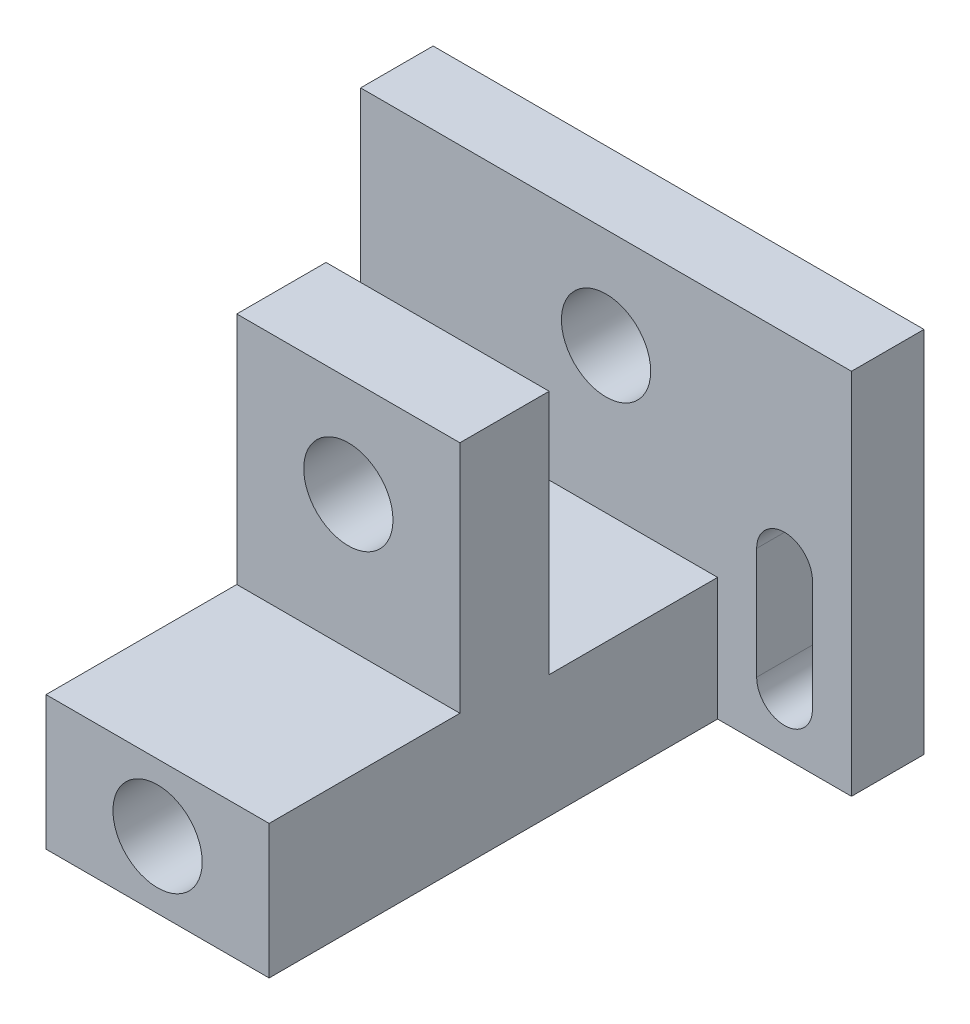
ISO-10303-21;
HEADER;
FILE_DESCRIPTION(('STEP AP214'),'2;1');
FILE_NAME('part.step','',(''),(''),'','','');
FILE_SCHEMA(('AUTOMOTIVE_DESIGN { 1 0 10303 214 1 1 1 1 }'));
ENDSEC;
DATA;
#1=APPLICATION_CONTEXT('core data for automotive mechanical design processes');
#2=APPLICATION_PROTOCOL_DEFINITION('international standard','automotive_design',2000,#1);
#3=PRODUCT_CONTEXT('',#1,'mechanical');
#4=PRODUCT('Part','Part','',(#3));
#5=PRODUCT_RELATED_PRODUCT_CATEGORY('part','',(#4));
#6=PRODUCT_DEFINITION_FORMATION('','',#4);
#7=PRODUCT_DEFINITION_CONTEXT('part definition',#1,'design');
#8=PRODUCT_DEFINITION('design','',#6,#7);
#9=PRODUCT_DEFINITION_SHAPE('','',#8);
#10=(LENGTH_UNIT() NAMED_UNIT(*) SI_UNIT(.MILLI.,.METRE.));
#11=(NAMED_UNIT(*) PLANE_ANGLE_UNIT() SI_UNIT($,.RADIAN.));
#12=(NAMED_UNIT(*) SI_UNIT($,.STERADIAN.) SOLID_ANGLE_UNIT());
#13=UNCERTAINTY_MEASURE_WITH_UNIT(LENGTH_MEASURE(1.E-05),#10,'distance_accuracy_value','');
#14=(GEOMETRIC_REPRESENTATION_CONTEXT(3) GLOBAL_UNCERTAINTY_ASSIGNED_CONTEXT((#13)) GLOBAL_UNIT_ASSIGNED_CONTEXT((#10,
#11,#12)) REPRESENTATION_CONTEXT('',''));
#15=CARTESIAN_POINT('',(0.,0.,0.));
#16=DIRECTION('',(0.,0.,1.));
#17=DIRECTION('',(1.,0.,0.));
#18=AXIS2_PLACEMENT_3D('',#15,#16,#17);
#19=CARTESIAN_POINT('',(20.,12.,23.35));
#20=DIRECTION('',(0.,0.,-1.));
#21=DIRECTION('',(0.,1.,0.));
#22=AXIS2_PLACEMENT_3D('',#19,#20,#21);
#23=PLANE('',#22);
#24=CARTESIAN_POINT('',(10.,6.,23.35));
#25=DIRECTION('',(0.,0.,1.));
#26=DIRECTION('',(1.,0.,0.));
#27=AXIS2_PLACEMENT_3D('',#24,#25,#26);
#28=CIRCLE('',#27,4.);
#29=CARTESIAN_POINT('',(14.,6.,23.35));
#30=VERTEX_POINT('',#29);
#31=EDGE_CURVE('E187',#30,#30,#28,.T.);
#32=ORIENTED_EDGE('',*,*,#31,.F.);
#33=EDGE_LOOP('',(#32));
#34=FACE_BOUND('',#33,.T.);
#35=DIRECTION('',(0.,-1.,0.));
#36=VECTOR('',#35,1.);
#37=CARTESIAN_POINT('',(0.,12.,23.35));
#38=LINE('',#37,#36);
#39=CARTESIAN_POINT('',(0.,12.,23.35));
#40=VERTEX_POINT('',#39);
#41=CARTESIAN_POINT('',(0.,0.,23.35));
#42=VERTEX_POINT('',#41);
#43=EDGE_CURVE('E318',#40,#42,#38,.T.);
#44=ORIENTED_EDGE('',*,*,#43,.T.);
#45=DIRECTION('',(-1.,0.,0.));
#46=VECTOR('',#45,1.);
#47=CARTESIAN_POINT('',(20.,0.,23.35));
#48=LINE('',#47,#46);
#49=CARTESIAN_POINT('',(20.,0.,23.35));
#50=VERTEX_POINT('',#49);
#51=EDGE_CURVE('E11',#50,#42,#48,.T.);
#52=ORIENTED_EDGE('',*,*,#51,.F.);
#53=DIRECTION('',(0.,-1.,0.));
#54=VECTOR('',#53,1.);
#55=CARTESIAN_POINT('',(20.,12.,23.35));
#56=LINE('',#55,#54);
#57=CARTESIAN_POINT('',(20.,12.,23.35));
#58=VERTEX_POINT('',#57);
#59=EDGE_CURVE('E293',#58,#50,#56,.T.);
#60=ORIENTED_EDGE('',*,*,#59,.F.);
#61=DIRECTION('',(-1.,0.,0.));
#62=VECTOR('',#61,1.);
#63=CARTESIAN_POINT('',(20.,12.,23.35));
#64=LINE('',#63,#62);
#65=EDGE_CURVE('E338',#58,#40,#64,.T.);
#66=ORIENTED_EDGE('',*,*,#65,.T.);
#67=EDGE_LOOP('',(#44,#52,#60,#66));
#68=FACE_BOUND('',#67,.T.);
#69=ADVANCED_FACE('F31',(#34,#68),#23,.F.);
#70=CARTESIAN_POINT('',(20.,0.,23.35));
#71=DIRECTION('',(0.,1.,0.));
#72=DIRECTION('',(0.,0.,1.));
#73=AXIS2_PLACEMENT_3D('',#70,#71,#72);
#74=PLANE('',#73);
#75=DIRECTION('',(0.,0.,-1.));
#76=VECTOR('',#75,1.);
#77=CARTESIAN_POINT('',(0.,0.,23.35));
#78=LINE('',#77,#76);
#79=CARTESIAN_POINT('',(0.,0.,-16.85));
#80=VERTEX_POINT('',#79);
#81=EDGE_CURVE('E321',#42,#80,#78,.T.);
#82=ORIENTED_EDGE('',*,*,#81,.T.);
#83=DIRECTION('',(-1.,0.,0.));
#84=VECTOR('',#83,1.);
#85=CARTESIAN_POINT('',(0.,0.,-16.85));
#86=LINE('',#85,#84);
#87=CARTESIAN_POINT('',(-12.,0.,-16.85));
#88=VERTEX_POINT('',#87);
#89=EDGE_CURVE('E265',#80,#88,#86,.T.);
#90=ORIENTED_EDGE('',*,*,#89,.T.);
#91=DIRECTION('',(0.,0.,-1.));
#92=VECTOR('',#91,1.);
#93=CARTESIAN_POINT('',(-12.,0.,-23.35));
#94=LINE('',#93,#92);
#95=CARTESIAN_POINT('',(-12.,0.,-23.35));
#96=VERTEX_POINT('',#95);
#97=EDGE_CURVE('E262',#88,#96,#94,.T.);
#98=ORIENTED_EDGE('',*,*,#97,.T.);
#99=DIRECTION('',(-1.,0.,0.));
#100=VECTOR('',#99,1.);
#101=CARTESIAN_POINT('',(20.,0.,-23.35));
#102=LINE('',#101,#100);
#103=CARTESIAN_POINT('',(32.,0.,-23.35));
#104=VERTEX_POINT('',#103);
#105=EDGE_CURVE('E39',#104,#96,#102,.T.);
#106=ORIENTED_EDGE('',*,*,#105,.F.);
#107=DIRECTION('',(0.,0.,1.));
#108=VECTOR('',#107,1.);
#109=CARTESIAN_POINT('',(32.,0.,-23.35));
#110=LINE('',#109,#108);
#111=CARTESIAN_POINT('',(32.,0.,-16.85));
#112=VERTEX_POINT('',#111);
#113=EDGE_CURVE('E276',#104,#112,#110,.T.);
#114=ORIENTED_EDGE('',*,*,#113,.T.);
#115=DIRECTION('',(-1.,0.,0.));
#116=VECTOR('',#115,1.);
#117=CARTESIAN_POINT('',(20.,0.,-16.85));
#118=LINE('',#117,#116);
#119=CARTESIAN_POINT('',(20.,0.,-16.85));
#120=VERTEX_POINT('',#119);
#121=EDGE_CURVE('E278',#112,#120,#118,.T.);
#122=ORIENTED_EDGE('',*,*,#121,.T.);
#123=DIRECTION('',(0.,0.,-1.));
#124=VECTOR('',#123,1.);
#125=CARTESIAN_POINT('',(20.,0.,23.35));
#126=LINE('',#125,#124);
#127=EDGE_CURVE('E296',#50,#120,#126,.T.);
#128=ORIENTED_EDGE('',*,*,#127,.F.);
#129=ORIENTED_EDGE('',*,*,#51,.T.);
#130=EDGE_LOOP('',(#82,#90,#98,#106,#114,#122,#128,#129));
#131=FACE_BOUND('',#130,.T.);
#132=ADVANCED_FACE('F364',(#131),#74,.F.);
#133=CARTESIAN_POINT('',(20.,0.,-23.35));
#134=DIRECTION('',(0.,0.,1.));
#135=DIRECTION('',(0.,-1.,0.));
#136=AXIS2_PLACEMENT_3D('',#133,#134,#135);
#137=PLANE('',#136);
#138=DIRECTION('',(0.,1.,0.));
#139=VECTOR('',#138,1.);
#140=CARTESIAN_POINT('',(-8.49999999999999,5.,-23.35));
#141=LINE('',#140,#139);
#142=CARTESIAN_POINT('',(-8.49999999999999,5.,-23.35));
#143=VERTEX_POINT('',#142);
#144=CARTESIAN_POINT('',(-8.49999999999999,15.,-23.35));
#145=VERTEX_POINT('',#144);
#146=EDGE_CURVE('E191',#143,#145,#141,.T.);
#147=ORIENTED_EDGE('',*,*,#146,.F.);
#148=CARTESIAN_POINT('',(-6.,5.,-23.35));
#149=DIRECTION('',(0.,0.,1.));
#150=DIRECTION('',(0.,-1.,0.));
#151=AXIS2_PLACEMENT_3D('',#148,#149,#150);
#152=CIRCLE('',#151,2.5);
#153=CARTESIAN_POINT('',(-3.5,5.,-23.35));
#154=VERTEX_POINT('',#153);
#155=EDGE_CURVE('E194',#154,#143,#152,.F.);
#156=ORIENTED_EDGE('',*,*,#155,.F.);
#157=DIRECTION('',(0.,-1.,0.));
#158=VECTOR('',#157,1.);
#159=CARTESIAN_POINT('',(-3.5,15.,-23.35));
#160=LINE('',#159,#158);
#161=CARTESIAN_POINT('',(-3.5,15.,-23.35));
#162=VERTEX_POINT('',#161);
#163=EDGE_CURVE('E210',#162,#154,#160,.T.);
#164=ORIENTED_EDGE('',*,*,#163,.F.);
#165=CARTESIAN_POINT('',(-6.,15.,-23.35));
#166=DIRECTION('',(0.,0.,1.));
#167=DIRECTION('',(0.,-1.,0.));
#168=AXIS2_PLACEMENT_3D('',#165,#166,#167);
#169=CIRCLE('',#168,2.5);
#170=EDGE_CURVE('E47',#145,#162,#169,.F.);
#171=ORIENTED_EDGE('',*,*,#170,.F.);
#172=EDGE_LOOP('',(#147,#156,#164,#171));
#173=FACE_BOUND('',#172,.T.);
#174=DIRECTION('',(0.,1.,0.));
#175=VECTOR('',#174,1.);
#176=CARTESIAN_POINT('',(23.5,5.,-23.35));
#177=LINE('',#176,#175);
#178=CARTESIAN_POINT('',(23.5,5.,-23.35));
#179=VERTEX_POINT('',#178);
#180=CARTESIAN_POINT('',(23.5,15.,-23.35));
#181=VERTEX_POINT('',#180);
#182=EDGE_CURVE('E220',#179,#181,#177,.T.);
#183=ORIENTED_EDGE('',*,*,#182,.F.);
#184=CARTESIAN_POINT('',(26.,5.,-23.35));
#185=DIRECTION('',(0.,0.,1.));
#186=DIRECTION('',(0.,-1.,0.));
#187=AXIS2_PLACEMENT_3D('',#184,#185,#186);
#188=CIRCLE('',#187,2.5);
#189=CARTESIAN_POINT('',(28.5,5.,-23.35));
#190=VERTEX_POINT('',#189);
#191=EDGE_CURVE('E223',#190,#179,#188,.F.);
#192=ORIENTED_EDGE('',*,*,#191,.F.);
#193=DIRECTION('',(0.,-1.,0.));
#194=VECTOR('',#193,1.);
#195=CARTESIAN_POINT('',(28.5,15.,-23.35));
#196=LINE('',#195,#194);
#197=CARTESIAN_POINT('',(28.5,15.,-23.35));
#198=VERTEX_POINT('',#197);
#199=EDGE_CURVE('E240',#198,#190,#196,.T.);
#200=ORIENTED_EDGE('',*,*,#199,.F.);
#201=CARTESIAN_POINT('',(26.,15.,-23.35));
#202=DIRECTION('',(0.,0.,1.));
#203=DIRECTION('',(0.,-1.,0.));
#204=AXIS2_PLACEMENT_3D('',#201,#202,#203);
#205=CIRCLE('',#204,2.5);
#206=EDGE_CURVE('E218',#181,#198,#205,.F.);
#207=ORIENTED_EDGE('',*,*,#206,.F.);
#208=EDGE_LOOP('',(#183,#192,#200,#207));
#209=FACE_BOUND('',#208,.T.);
#210=CARTESIAN_POINT('',(10.,24.,-23.35));
#211=DIRECTION('',(0.,0.,1.));
#212=DIRECTION('',(1.,0.,0.));
#213=AXIS2_PLACEMENT_3D('',#210,#211,#212);
#214=CIRCLE('',#213,3.99999999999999);
#215=CARTESIAN_POINT('',(14.,24.,-23.35));
#216=VERTEX_POINT('',#215);
#217=EDGE_CURVE('E249',#216,#216,#214,.T.);
#218=ORIENTED_EDGE('',*,*,#217,.T.);
#219=EDGE_LOOP('',(#218));
#220=FACE_BOUND('',#219,.T.);
#221=ORIENTED_EDGE('',*,*,#105,.T.);
#222=DIRECTION('',(0.,1.,0.));
#223=VECTOR('',#222,1.);
#224=CARTESIAN_POINT('',(-12.,-13.6473440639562,-23.35));
#225=LINE('',#224,#223);
#226=CARTESIAN_POINT('',(-12.,33.,-23.35));
#227=VERTEX_POINT('',#226);
#228=EDGE_CURVE('E269',#96,#227,#225,.T.);
#229=ORIENTED_EDGE('',*,*,#228,.T.);
#230=DIRECTION('',(-1.,0.,0.));
#231=VECTOR('',#230,1.);
#232=CARTESIAN_POINT('',(20.,33.,-23.35));
#233=LINE('',#232,#231);
#234=CARTESIAN_POINT('',(32.,33.,-23.35));
#235=VERTEX_POINT('',#234);
#236=EDGE_CURVE('E354',#235,#227,#233,.T.);
#237=ORIENTED_EDGE('',*,*,#236,.F.);
#238=DIRECTION('',(0.,1.,0.));
#239=VECTOR('',#238,1.);
#240=CARTESIAN_POINT('',(32.,-13.6473440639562,-23.35));
#241=LINE('',#240,#239);
#242=EDGE_CURVE('E279',#104,#235,#241,.T.);
#243=ORIENTED_EDGE('',*,*,#242,.F.);
#244=EDGE_LOOP('',(#221,#229,#237,#243));
#245=FACE_BOUND('',#244,.T.);
#246=ADVANCED_FACE('F358',(#173,#209,#220,#245),#137,.F.);
#247=CARTESIAN_POINT('',(20.,33.,-23.35));
#248=DIRECTION('',(0.,-1.,0.));
#249=DIRECTION('',(0.,0.,-1.));
#250=AXIS2_PLACEMENT_3D('',#247,#248,#249);
#251=PLANE('',#250);
#252=ORIENTED_EDGE('',*,*,#236,.T.);
#253=DIRECTION('',(0.,0.,1.));
#254=VECTOR('',#253,1.);
#255=CARTESIAN_POINT('',(-12.,33.,-23.35));
#256=LINE('',#255,#254);
#257=CARTESIAN_POINT('',(-12.,33.,-16.85));
#258=VERTEX_POINT('',#257);
#259=EDGE_CURVE('E261',#227,#258,#256,.T.);
#260=ORIENTED_EDGE('',*,*,#259,.T.);
#261=DIRECTION('',(-1.,0.,0.));
#262=VECTOR('',#261,1.);
#263=CARTESIAN_POINT('',(20.,33.,-16.85));
#264=LINE('',#263,#262);
#265=CARTESIAN_POINT('',(32.,33.,-16.85));
#266=VERTEX_POINT('',#265);
#267=EDGE_CURVE('E312',#266,#258,#264,.T.);
#268=ORIENTED_EDGE('',*,*,#267,.F.);
#269=DIRECTION('',(0.,0.,-1.));
#270=VECTOR('',#269,1.);
#271=CARTESIAN_POINT('',(32.,33.,-23.35));
#272=LINE('',#271,#270);
#273=EDGE_CURVE('E280',#266,#235,#272,.T.);
#274=ORIENTED_EDGE('',*,*,#273,.T.);
#275=EDGE_LOOP('',(#252,#260,#268,#274));
#276=FACE_BOUND('',#275,.T.);
#277=ADVANCED_FACE('F371',(#276),#251,.F.);
#278=CARTESIAN_POINT('',(20.,33.,-16.85));
#279=DIRECTION('',(0.,0.,-1.));
#280=DIRECTION('',(0.,1.,0.));
#281=AXIS2_PLACEMENT_3D('',#278,#279,#280);
#282=PLANE('',#281);
#283=DIRECTION('',(0.,1.,0.));
#284=VECTOR('',#283,1.);
#285=CARTESIAN_POINT('',(-3.5,15.,-16.85));
#286=LINE('',#285,#284);
#287=CARTESIAN_POINT('',(-3.5,5.,-16.85));
#288=VERTEX_POINT('',#287);
#289=CARTESIAN_POINT('',(-3.5,15.,-16.85));
#290=VERTEX_POINT('',#289);
#291=EDGE_CURVE('E198',#288,#290,#286,.T.);
#292=ORIENTED_EDGE('',*,*,#291,.F.);
#293=CARTESIAN_POINT('',(-6.,5.,-16.85));
#294=DIRECTION('',(0.,0.,1.));
#295=DIRECTION('',(-1.,0.,0.));
#296=AXIS2_PLACEMENT_3D('',#293,#294,#295);
#297=CIRCLE('',#296,2.5);
#298=CARTESIAN_POINT('',(-8.49999999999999,5.,-16.85));
#299=VERTEX_POINT('',#298);
#300=EDGE_CURVE('E55',#299,#288,#297,.T.);
#301=ORIENTED_EDGE('',*,*,#300,.F.);
#302=DIRECTION('',(0.,-1.,0.));
#303=VECTOR('',#302,1.);
#304=CARTESIAN_POINT('',(-8.49999999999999,5.,-16.85));
#305=LINE('',#304,#303);
#306=CARTESIAN_POINT('',(-8.49999999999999,15.,-16.85));
#307=VERTEX_POINT('',#306);
#308=EDGE_CURVE('E204',#307,#299,#305,.T.);
#309=ORIENTED_EDGE('',*,*,#308,.F.);
#310=CARTESIAN_POINT('',(-6.,15.,-16.85));
#311=DIRECTION('',(0.,0.,1.));
#312=DIRECTION('',(-1.,0.,0.));
#313=AXIS2_PLACEMENT_3D('',#310,#311,#312);
#314=CIRCLE('',#313,2.5);
#315=EDGE_CURVE('E201',#290,#307,#314,.T.);
#316=ORIENTED_EDGE('',*,*,#315,.F.);
#317=EDGE_LOOP('',(#292,#301,#309,#316));
#318=FACE_BOUND('',#317,.T.);
#319=DIRECTION('',(0.,1.,0.));
#320=VECTOR('',#319,1.);
#321=CARTESIAN_POINT('',(28.5,15.,-16.85));
#322=LINE('',#321,#320);
#323=CARTESIAN_POINT('',(28.5,5.,-16.85));
#324=VERTEX_POINT('',#323);
#325=CARTESIAN_POINT('',(28.5,15.,-16.85));
#326=VERTEX_POINT('',#325);
#327=EDGE_CURVE('E228',#324,#326,#322,.T.);
#328=ORIENTED_EDGE('',*,*,#327,.F.);
#329=CARTESIAN_POINT('',(26.,5.,-16.85));
#330=DIRECTION('',(0.,0.,1.));
#331=DIRECTION('',(-1.,0.,0.));
#332=AXIS2_PLACEMENT_3D('',#329,#330,#331);
#333=CIRCLE('',#332,2.5);
#334=CARTESIAN_POINT('',(23.5,5.,-16.85));
#335=VERTEX_POINT('',#334);
#336=EDGE_CURVE('E226',#335,#324,#333,.T.);
#337=ORIENTED_EDGE('',*,*,#336,.F.);
#338=DIRECTION('',(0.,-1.,0.));
#339=VECTOR('',#338,1.);
#340=CARTESIAN_POINT('',(23.5,5.,-16.85));
#341=LINE('',#340,#339);
#342=CARTESIAN_POINT('',(23.5,15.,-16.85));
#343=VERTEX_POINT('',#342);
#344=EDGE_CURVE('E234',#343,#335,#341,.T.);
#345=ORIENTED_EDGE('',*,*,#344,.F.);
#346=CARTESIAN_POINT('',(26.,15.,-16.85));
#347=DIRECTION('',(0.,0.,1.));
#348=DIRECTION('',(-1.,0.,0.));
#349=AXIS2_PLACEMENT_3D('',#346,#347,#348);
#350=CIRCLE('',#349,2.5);
#351=EDGE_CURVE('E231',#326,#343,#350,.T.);
#352=ORIENTED_EDGE('',*,*,#351,.F.);
#353=EDGE_LOOP('',(#328,#337,#345,#352));
#354=FACE_BOUND('',#353,.T.);
#355=CARTESIAN_POINT('',(10.,24.,-16.85));
#356=DIRECTION('',(0.,0.,-1.));
#357=DIRECTION('',(0.,1.,0.));
#358=AXIS2_PLACEMENT_3D('',#355,#356,#357);
#359=CIRCLE('',#358,3.99999999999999);
#360=CARTESIAN_POINT('',(10.,28.,-16.85));
#361=VERTEX_POINT('',#360);
#362=EDGE_CURVE('E255',#361,#361,#359,.T.);
#363=ORIENTED_EDGE('',*,*,#362,.T.);
#364=EDGE_LOOP('',(#363));
#365=FACE_BOUND('',#364,.T.);
#366=ORIENTED_EDGE('',*,*,#267,.T.);
#367=DIRECTION('',(0.,1.,0.));
#368=VECTOR('',#367,1.);
#369=CARTESIAN_POINT('',(-12.,-13.6473440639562,-16.85));
#370=LINE('',#369,#368);
#371=EDGE_CURVE('E272',#88,#258,#370,.T.);
#372=ORIENTED_EDGE('',*,*,#371,.F.);
#373=ORIENTED_EDGE('',*,*,#89,.F.);
#374=DIRECTION('',(0.,1.,0.));
#375=VECTOR('',#374,1.);
#376=CARTESIAN_POINT('',(0.,-13.6473440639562,-16.85));
#377=LINE('',#376,#375);
#378=CARTESIAN_POINT('',(0.,11.,-16.85));
#379=VERTEX_POINT('',#378);
#380=EDGE_CURVE('E266',#80,#379,#377,.T.);
#381=ORIENTED_EDGE('',*,*,#380,.T.);
#382=DIRECTION('',(-1.,0.,0.));
#383=VECTOR('',#382,1.);
#384=CARTESIAN_POINT('',(20.,11.,-16.85));
#385=LINE('',#384,#383);
#386=CARTESIAN_POINT('',(20.,11.,-16.85));
#387=VERTEX_POINT('',#386);
#388=EDGE_CURVE('E309',#387,#379,#385,.T.);
#389=ORIENTED_EDGE('',*,*,#388,.F.);
#390=DIRECTION('',(0.,1.,0.));
#391=VECTOR('',#390,1.);
#392=CARTESIAN_POINT('',(20.,-13.6473440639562,-16.85));
#393=LINE('',#392,#391);
#394=EDGE_CURVE('E283',#120,#387,#393,.T.);
#395=ORIENTED_EDGE('',*,*,#394,.F.);
#396=ORIENTED_EDGE('',*,*,#121,.F.);
#397=DIRECTION('',(0.,1.,0.));
#398=VECTOR('',#397,1.);
#399=CARTESIAN_POINT('',(32.,-13.6473440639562,-16.85));
#400=LINE('',#399,#398);
#401=EDGE_CURVE('E286',#112,#266,#400,.T.);
#402=ORIENTED_EDGE('',*,*,#401,.T.);
#403=EDGE_LOOP('',(#366,#372,#373,#381,#389,#395,#396,#402));
#404=FACE_BOUND('',#403,.T.);
#405=ADVANCED_FACE('F379',(#318,#354,#365,#404),#282,.F.);
#406=CARTESIAN_POINT('',(20.,11.,-16.85));
#407=DIRECTION('',(0.,-1.,0.));
#408=DIRECTION('',(0.,0.,-1.));
#409=AXIS2_PLACEMENT_3D('',#406,#407,#408);
#410=PLANE('',#409);
#411=DIRECTION('',(0.,0.,1.));
#412=VECTOR('',#411,1.);
#413=CARTESIAN_POINT('',(0.,11.,-16.85));
#414=LINE('',#413,#412);
#415=CARTESIAN_POINT('',(0.,11.,-1.75));
#416=VERTEX_POINT('',#415);
#417=EDGE_CURVE('E325',#379,#416,#414,.T.);
#418=ORIENTED_EDGE('',*,*,#417,.T.);
#419=DIRECTION('',(-1.,0.,0.));
#420=VECTOR('',#419,1.);
#421=CARTESIAN_POINT('',(20.,11.,-1.75));
#422=LINE('',#421,#420);
#423=CARTESIAN_POINT('',(20.,11.,-1.75));
#424=VERTEX_POINT('',#423);
#425=EDGE_CURVE('E313',#424,#416,#422,.T.);
#426=ORIENTED_EDGE('',*,*,#425,.F.);
#427=DIRECTION('',(0.,0.,1.));
#428=VECTOR('',#427,1.);
#429=CARTESIAN_POINT('',(20.,11.,-16.85));
#430=LINE('',#429,#428);
#431=EDGE_CURVE('E304',#387,#424,#430,.T.);
#432=ORIENTED_EDGE('',*,*,#431,.F.);
#433=ORIENTED_EDGE('',*,*,#388,.T.);
#434=EDGE_LOOP('',(#418,#426,#432,#433));
#435=FACE_BOUND('',#434,.T.);
#436=ADVANCED_FACE('F397',(#435),#410,.F.);
#437=CARTESIAN_POINT('',(20.,11.,-1.75));
#438=DIRECTION('',(0.,0.,1.));
#439=DIRECTION('',(0.,-1.,0.));
#440=AXIS2_PLACEMENT_3D('',#437,#438,#439);
#441=PLANE('',#440);
#442=CARTESIAN_POINT('',(10.,24.,-1.74999999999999));
#443=DIRECTION('',(0.,0.,1.));
#444=DIRECTION('',(0.,-1.,0.));
#445=AXIS2_PLACEMENT_3D('',#442,#443,#444);
#446=CIRCLE('',#445,3.99999999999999);
#447=CARTESIAN_POINT('',(10.,20.,-1.74999999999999));
#448=VERTEX_POINT('',#447);
#449=EDGE_CURVE('E258',#448,#448,#446,.T.);
#450=ORIENTED_EDGE('',*,*,#449,.T.);
#451=EDGE_LOOP('',(#450));
#452=FACE_BOUND('',#451,.T.);
#453=DIRECTION('',(0.,1.,0.));
#454=VECTOR('',#453,1.);
#455=CARTESIAN_POINT('',(0.,11.,-1.75));
#456=LINE('',#455,#454);
#457=CARTESIAN_POINT('',(0.,33.,-1.74999999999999));
#458=VERTEX_POINT('',#457);
#459=EDGE_CURVE('E331',#416,#458,#456,.T.);
#460=ORIENTED_EDGE('',*,*,#459,.T.);
#461=DIRECTION('',(-1.,0.,0.));
#462=VECTOR('',#461,1.);
#463=CARTESIAN_POINT('',(20.,33.,-1.74999999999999));
#464=LINE('',#463,#462);
#465=CARTESIAN_POINT('',(20.,33.,-1.74999999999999));
#466=VERTEX_POINT('',#465);
#467=EDGE_CURVE('E348',#466,#458,#464,.T.);
#468=ORIENTED_EDGE('',*,*,#467,.F.);
#469=DIRECTION('',(0.,1.,0.));
#470=VECTOR('',#469,1.);
#471=CARTESIAN_POINT('',(20.,11.,-1.75));
#472=LINE('',#471,#470);
#473=EDGE_CURVE('E300',#424,#466,#472,.T.);
#474=ORIENTED_EDGE('',*,*,#473,.F.);
#475=ORIENTED_EDGE('',*,*,#425,.T.);
#476=EDGE_LOOP('',(#460,#468,#474,#475));
#477=FACE_BOUND('',#476,.T.);
#478=ADVANCED_FACE('F401',(#452,#477),#441,.F.);
#479=CARTESIAN_POINT('',(20.,33.,-1.74999999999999));
#480=DIRECTION('',(0.,-1.,0.));
#481=DIRECTION('',(0.,0.,-1.));
#482=AXIS2_PLACEMENT_3D('',#479,#480,#481);
#483=PLANE('',#482);
#484=DIRECTION('',(0.,0.,1.));
#485=VECTOR('',#484,1.);
#486=CARTESIAN_POINT('',(0.,33.,-1.74999999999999));
#487=LINE('',#486,#485);
#488=CARTESIAN_POINT('',(0.,33.,6.25000000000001));
#489=VERTEX_POINT('',#488);
#490=EDGE_CURVE('E333',#458,#489,#487,.T.);
#491=ORIENTED_EDGE('',*,*,#490,.T.);
#492=DIRECTION('',(-1.,0.,0.));
#493=VECTOR('',#492,1.);
#494=CARTESIAN_POINT('',(20.,33.,6.25000000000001));
#495=LINE('',#494,#493);
#496=CARTESIAN_POINT('',(20.,33.,6.25000000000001));
#497=VERTEX_POINT('',#496);
#498=EDGE_CURVE('E345',#497,#489,#495,.T.);
#499=ORIENTED_EDGE('',*,*,#498,.F.);
#500=DIRECTION('',(0.,0.,1.));
#501=VECTOR('',#500,1.);
#502=CARTESIAN_POINT('',(20.,33.,-1.74999999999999));
#503=LINE('',#502,#501);
#504=EDGE_CURVE('E403',#466,#497,#503,.T.);
#505=ORIENTED_EDGE('',*,*,#504,.F.);
#506=ORIENTED_EDGE('',*,*,#467,.T.);
#507=EDGE_LOOP('',(#491,#499,#505,#506));
#508=FACE_BOUND('',#507,.T.);
#509=ADVANCED_FACE('F416',(#508),#483,.F.);
#510=CARTESIAN_POINT('',(20.,33.,6.25000000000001));
#511=DIRECTION('',(0.,0.,-1.));
#512=DIRECTION('',(0.,1.,0.));
#513=AXIS2_PLACEMENT_3D('',#510,#511,#512);
#514=PLANE('',#513);
#515=CARTESIAN_POINT('',(10.,24.,6.25));
#516=DIRECTION('',(0.,0.,1.));
#517=DIRECTION('',(1.,0.,0.));
#518=AXIS2_PLACEMENT_3D('',#515,#516,#517);
#519=CIRCLE('',#518,3.99999999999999);
#520=CARTESIAN_POINT('',(14.,24.,6.25));
#521=VERTEX_POINT('',#520);
#522=EDGE_CURVE('E252',#521,#521,#519,.T.);
#523=ORIENTED_EDGE('',*,*,#522,.F.);
#524=EDGE_LOOP('',(#523));
#525=FACE_BOUND('',#524,.T.);
#526=DIRECTION('',(0.,-1.,0.));
#527=VECTOR('',#526,1.);
#528=CARTESIAN_POINT('',(0.,33.,6.25000000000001));
#529=LINE('',#528,#527);
#530=CARTESIAN_POINT('',(0.,12.,6.25));
#531=VERTEX_POINT('',#530);
#532=EDGE_CURVE('E335',#489,#531,#529,.T.);
#533=ORIENTED_EDGE('',*,*,#532,.T.);
#534=DIRECTION('',(-1.,0.,0.));
#535=VECTOR('',#534,1.);
#536=CARTESIAN_POINT('',(20.,12.,6.25));
#537=LINE('',#536,#535);
#538=CARTESIAN_POINT('',(20.,12.,6.25));
#539=VERTEX_POINT('',#538);
#540=EDGE_CURVE('E341',#539,#531,#537,.T.);
#541=ORIENTED_EDGE('',*,*,#540,.F.);
#542=DIRECTION('',(0.,-1.,0.));
#543=VECTOR('',#542,1.);
#544=CARTESIAN_POINT('',(20.,33.,6.25000000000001));
#545=LINE('',#544,#543);
#546=EDGE_CURVE('E404',#497,#539,#545,.T.);
#547=ORIENTED_EDGE('',*,*,#546,.F.);
#548=ORIENTED_EDGE('',*,*,#498,.T.);
#549=EDGE_LOOP('',(#533,#541,#547,#548));
#550=FACE_BOUND('',#549,.T.);
#551=ADVANCED_FACE('F410',(#525,#550),#514,.F.);
#552=CARTESIAN_POINT('',(20.,12.,6.25));
#553=DIRECTION('',(0.,-1.,0.));
#554=DIRECTION('',(0.,0.,-1.));
#555=AXIS2_PLACEMENT_3D('',#552,#553,#554);
#556=PLANE('',#555);
#557=DIRECTION('',(0.,0.,1.));
#558=VECTOR('',#557,1.);
#559=CARTESIAN_POINT('',(0.,12.,6.25));
#560=LINE('',#559,#558);
#561=EDGE_CURVE('E297',#531,#40,#560,.T.);
#562=ORIENTED_EDGE('',*,*,#561,.T.);
#563=ORIENTED_EDGE('',*,*,#65,.F.);
#564=DIRECTION('',(0.,0.,1.));
#565=VECTOR('',#564,1.);
#566=CARTESIAN_POINT('',(20.,12.,6.25));
#567=LINE('',#566,#565);
#568=EDGE_CURVE('E342',#539,#58,#567,.T.);
#569=ORIENTED_EDGE('',*,*,#568,.F.);
#570=ORIENTED_EDGE('',*,*,#540,.T.);
#571=EDGE_LOOP('',(#562,#563,#569,#570));
#572=FACE_BOUND('',#571,.T.);
#573=ADVANCED_FACE('F413',(#572),#556,.F.);
#574=CARTESIAN_POINT('',(20.,33.,23.35));
#575=DIRECTION('',(-1.,0.,0.));
#576=DIRECTION('',(0.,0.,1.));
#577=AXIS2_PLACEMENT_3D('',#574,#575,#576);
#578=PLANE('',#577);
#579=ORIENTED_EDGE('',*,*,#127,.T.);
#580=ORIENTED_EDGE('',*,*,#394,.T.);
#581=ORIENTED_EDGE('',*,*,#431,.T.);
#582=ORIENTED_EDGE('',*,*,#473,.T.);
#583=ORIENTED_EDGE('',*,*,#504,.T.);
#584=ORIENTED_EDGE('',*,*,#546,.T.);
#585=ORIENTED_EDGE('',*,*,#568,.T.);
#586=ORIENTED_EDGE('',*,*,#59,.T.);
#587=EDGE_LOOP('',(#579,#580,#581,#582,#583,#584,#585,#586));
#588=FACE_BOUND('',#587,.T.);
#589=ADVANCED_FACE('F381',(#588),#578,.F.);
#590=CARTESIAN_POINT('',(0.,33.,23.35));
#591=DIRECTION('',(-1.,0.,0.));
#592=DIRECTION('',(0.,0.,1.));
#593=AXIS2_PLACEMENT_3D('',#590,#591,#592);
#594=PLANE('',#593);
#595=ORIENTED_EDGE('',*,*,#380,.F.);
#596=ORIENTED_EDGE('',*,*,#81,.F.);
#597=ORIENTED_EDGE('',*,*,#43,.F.);
#598=ORIENTED_EDGE('',*,*,#561,.F.);
#599=ORIENTED_EDGE('',*,*,#532,.F.);
#600=ORIENTED_EDGE('',*,*,#490,.F.);
#601=ORIENTED_EDGE('',*,*,#459,.F.);
#602=ORIENTED_EDGE('',*,*,#417,.F.);
#603=EDGE_LOOP('',(#595,#596,#597,#598,#599,#600,#601,#602));
#604=FACE_BOUND('',#603,.T.);
#605=ADVANCED_FACE('F392',(#604),#594,.T.);
#606=CARTESIAN_POINT('',(32.,-13.6473440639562,-23.35));
#607=DIRECTION('',(1.,0.,0.));
#608=DIRECTION('',(0.,0.,-1.));
#609=AXIS2_PLACEMENT_3D('',#606,#607,#608);
#610=PLANE('',#609);
#611=ORIENTED_EDGE('',*,*,#113,.F.);
#612=ORIENTED_EDGE('',*,*,#242,.T.);
#613=ORIENTED_EDGE('',*,*,#273,.F.);
#614=ORIENTED_EDGE('',*,*,#401,.F.);
#615=EDGE_LOOP('',(#611,#612,#613,#614));
#616=FACE_BOUND('',#615,.T.);
#617=ADVANCED_FACE('F374',(#616),#610,.T.);
#618=CARTESIAN_POINT('',(-12.,-13.6473440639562,-23.35));
#619=DIRECTION('',(-1.,0.,0.));
#620=DIRECTION('',(0.,0.,1.));
#621=AXIS2_PLACEMENT_3D('',#618,#619,#620);
#622=PLANE('',#621);
#623=ORIENTED_EDGE('',*,*,#97,.F.);
#624=ORIENTED_EDGE('',*,*,#371,.T.);
#625=ORIENTED_EDGE('',*,*,#259,.F.);
#626=ORIENTED_EDGE('',*,*,#228,.F.);
#627=EDGE_LOOP('',(#623,#624,#625,#626));
#628=FACE_BOUND('',#627,.T.);
#629=ADVANCED_FACE('F368',(#628),#622,.T.);
#630=CARTESIAN_POINT('',(10.,24.,6.25));
#631=DIRECTION('',(0.,0.,1.));
#632=DIRECTION('',(1.,0.,0.));
#633=AXIS2_PLACEMENT_3D('',#630,#631,#632);
#634=CYLINDRICAL_SURFACE('',#633,3.99999999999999);
#635=ORIENTED_EDGE('',*,*,#522,.T.);
#636=EDGE_LOOP('',(#635));
#637=FACE_BOUND('',#636,.T.);
#638=ORIENTED_EDGE('',*,*,#449,.F.);
#639=EDGE_LOOP('',(#638));
#640=FACE_BOUND('',#639,.T.);
#641=ADVANCED_FACE('F478',(#637,#640),#634,.F.);
#642=ORIENTED_EDGE('',*,*,#217,.F.);
#643=EDGE_LOOP('',(#642));
#644=FACE_BOUND('',#643,.T.);
#645=ORIENTED_EDGE('',*,*,#362,.F.);
#646=EDGE_LOOP('',(#645));
#647=FACE_BOUND('',#646,.T.);
#648=ADVANCED_FACE('F476',(#644,#647),#634,.F.);
#649=CARTESIAN_POINT('',(26.,5.,-23.351));
#650=DIRECTION('',(0.,0.,1.));
#651=DIRECTION('',(1.,0.,0.));
#652=AXIS2_PLACEMENT_3D('',#649,#650,#651);
#653=CYLINDRICAL_SURFACE('',#652,2.5);
#654=ORIENTED_EDGE('',*,*,#191,.T.);
#655=DIRECTION('',(0.,0.,1.));
#656=VECTOR('',#655,1.);
#657=CARTESIAN_POINT('',(23.5,5.,-23.351));
#658=LINE('',#657,#656);
#659=EDGE_CURVE('E238',#179,#335,#658,.T.);
#660=ORIENTED_EDGE('',*,*,#659,.T.);
#661=ORIENTED_EDGE('',*,*,#336,.T.);
#662=DIRECTION('',(0.,0.,1.));
#663=VECTOR('',#662,1.);
#664=CARTESIAN_POINT('',(28.5,5.,-23.351));
#665=LINE('',#664,#663);
#666=EDGE_CURVE('E237',#190,#324,#665,.T.);
#667=ORIENTED_EDGE('',*,*,#666,.F.);
#668=EDGE_LOOP('',(#654,#660,#661,#667));
#669=FACE_BOUND('',#668,.T.);
#670=ADVANCED_FACE('F466',(#669),#653,.F.);
#671=CARTESIAN_POINT('',(23.5,5.,-23.351));
#672=DIRECTION('',(-1.,0.,0.));
#673=DIRECTION('',(0.,0.,1.));
#674=AXIS2_PLACEMENT_3D('',#671,#672,#673);
#675=PLANE('',#674);
#676=ORIENTED_EDGE('',*,*,#182,.T.);
#677=DIRECTION('',(0.,0.,1.));
#678=VECTOR('',#677,1.);
#679=CARTESIAN_POINT('',(23.5,15.,-23.351));
#680=LINE('',#679,#678);
#681=EDGE_CURVE('E241',#181,#343,#680,.T.);
#682=ORIENTED_EDGE('',*,*,#681,.T.);
#683=ORIENTED_EDGE('',*,*,#344,.T.);
#684=ORIENTED_EDGE('',*,*,#659,.F.);
#685=EDGE_LOOP('',(#676,#682,#683,#684));
#686=FACE_BOUND('',#685,.T.);
#687=ADVANCED_FACE('F462',(#686),#675,.F.);
#688=CARTESIAN_POINT('',(26.,15.,-23.351));
#689=DIRECTION('',(0.,0.,1.));
#690=DIRECTION('',(1.,0.,0.));
#691=AXIS2_PLACEMENT_3D('',#688,#689,#690);
#692=CYLINDRICAL_SURFACE('',#691,2.5);
#693=ORIENTED_EDGE('',*,*,#206,.T.);
#694=DIRECTION('',(0.,0.,1.));
#695=VECTOR('',#694,1.);
#696=CARTESIAN_POINT('',(28.5,15.,-23.351));
#697=LINE('',#696,#695);
#698=EDGE_CURVE('E243',#198,#326,#697,.T.);
#699=ORIENTED_EDGE('',*,*,#698,.T.);
#700=ORIENTED_EDGE('',*,*,#351,.T.);
#701=ORIENTED_EDGE('',*,*,#681,.F.);
#702=EDGE_LOOP('',(#693,#699,#700,#701));
#703=FACE_BOUND('',#702,.T.);
#704=ADVANCED_FACE('F465',(#703),#692,.F.);
#705=CARTESIAN_POINT('',(28.5,15.,-23.351));
#706=DIRECTION('',(1.,0.,0.));
#707=DIRECTION('',(0.,0.,-1.));
#708=AXIS2_PLACEMENT_3D('',#705,#706,#707);
#709=PLANE('',#708);
#710=ORIENTED_EDGE('',*,*,#199,.T.);
#711=ORIENTED_EDGE('',*,*,#666,.T.);
#712=ORIENTED_EDGE('',*,*,#327,.T.);
#713=ORIENTED_EDGE('',*,*,#698,.F.);
#714=EDGE_LOOP('',(#710,#711,#712,#713));
#715=FACE_BOUND('',#714,.T.);
#716=ADVANCED_FACE('F461',(#715),#709,.F.);
#717=CARTESIAN_POINT('',(-6.,5.,-23.351));
#718=DIRECTION('',(0.,0.,1.));
#719=DIRECTION('',(1.,0.,0.));
#720=AXIS2_PLACEMENT_3D('',#717,#718,#719);
#721=CYLINDRICAL_SURFACE('',#720,2.5);
#722=ORIENTED_EDGE('',*,*,#155,.T.);
#723=DIRECTION('',(0.,0.,1.));
#724=VECTOR('',#723,1.);
#725=CARTESIAN_POINT('',(-8.49999999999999,5.,-23.351));
#726=LINE('',#725,#724);
#727=EDGE_CURVE('E208',#143,#299,#726,.T.);
#728=ORIENTED_EDGE('',*,*,#727,.T.);
#729=ORIENTED_EDGE('',*,*,#300,.T.);
#730=DIRECTION('',(0.,0.,1.));
#731=VECTOR('',#730,1.);
#732=CARTESIAN_POINT('',(-3.5,5.,-23.351));
#733=LINE('',#732,#731);
#734=EDGE_CURVE('E207',#154,#288,#733,.T.);
#735=ORIENTED_EDGE('',*,*,#734,.F.);
#736=EDGE_LOOP('',(#722,#728,#729,#735));
#737=FACE_BOUND('',#736,.T.);
#738=ADVANCED_FACE('F455',(#737),#721,.F.);
#739=CARTESIAN_POINT('',(-8.49999999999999,5.,-23.351));
#740=DIRECTION('',(-1.,0.,0.));
#741=DIRECTION('',(0.,0.,1.));
#742=AXIS2_PLACEMENT_3D('',#739,#740,#741);
#743=PLANE('',#742);
#744=ORIENTED_EDGE('',*,*,#146,.T.);
#745=DIRECTION('',(0.,0.,1.));
#746=VECTOR('',#745,1.);
#747=CARTESIAN_POINT('',(-8.49999999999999,15.,-23.351));
#748=LINE('',#747,#746);
#749=EDGE_CURVE('E211',#145,#307,#748,.T.);
#750=ORIENTED_EDGE('',*,*,#749,.T.);
#751=ORIENTED_EDGE('',*,*,#308,.T.);
#752=ORIENTED_EDGE('',*,*,#727,.F.);
#753=EDGE_LOOP('',(#744,#750,#751,#752));
#754=FACE_BOUND('',#753,.T.);
#755=ADVANCED_FACE('F452',(#754),#743,.F.);
#756=CARTESIAN_POINT('',(-6.,15.,-23.351));
#757=DIRECTION('',(0.,0.,1.));
#758=DIRECTION('',(1.,0.,0.));
#759=AXIS2_PLACEMENT_3D('',#756,#757,#758);
#760=CYLINDRICAL_SURFACE('',#759,2.5);
#761=ORIENTED_EDGE('',*,*,#170,.T.);
#762=DIRECTION('',(0.,0.,1.));
#763=VECTOR('',#762,1.);
#764=CARTESIAN_POINT('',(-3.5,15.,-23.351));
#765=LINE('',#764,#763);
#766=EDGE_CURVE('E213',#162,#290,#765,.T.);
#767=ORIENTED_EDGE('',*,*,#766,.T.);
#768=ORIENTED_EDGE('',*,*,#315,.T.);
#769=ORIENTED_EDGE('',*,*,#749,.F.);
#770=EDGE_LOOP('',(#761,#767,#768,#769));
#771=FACE_BOUND('',#770,.T.);
#772=ADVANCED_FACE('F446',(#771),#760,.F.);
#773=CARTESIAN_POINT('',(-3.5,15.,-23.351));
#774=DIRECTION('',(1.,0.,0.));
#775=DIRECTION('',(0.,1.,0.));
#776=AXIS2_PLACEMENT_3D('',#773,#774,#775);
#777=PLANE('',#776);
#778=ORIENTED_EDGE('',*,*,#163,.T.);
#779=ORIENTED_EDGE('',*,*,#734,.T.);
#780=ORIENTED_EDGE('',*,*,#291,.T.);
#781=ORIENTED_EDGE('',*,*,#766,.F.);
#782=EDGE_LOOP('',(#778,#779,#780,#781));
#783=FACE_BOUND('',#782,.T.);
#784=ADVANCED_FACE('F437',(#783),#777,.F.);
#785=CARTESIAN_POINT('',(10.,6.,23.35));
#786=DIRECTION('',(0.,0.,1.));
#787=DIRECTION('',(1.,0.,0.));
#788=AXIS2_PLACEMENT_3D('',#785,#786,#787);
#789=CYLINDRICAL_SURFACE('',#788,4.);
#790=CARTESIAN_POINT('',(10.,6.,-2.65));
#791=DIRECTION('',(0.,0.,1.));
#792=DIRECTION('',(1.,0.,0.));
#793=AXIS2_PLACEMENT_3D('',#790,#791,#792);
#794=CIRCLE('',#793,3.99999999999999);
#795=CARTESIAN_POINT('',(14.,6.,-2.65));
#796=VERTEX_POINT('',#795);
#797=EDGE_CURVE('E182',#796,#796,#794,.T.);
#798=ORIENTED_EDGE('',*,*,#797,.F.);
#799=EDGE_LOOP('',(#798));
#800=FACE_BOUND('',#799,.T.);
#801=ORIENTED_EDGE('',*,*,#31,.T.);
#802=EDGE_LOOP('',(#801));
#803=FACE_BOUND('',#802,.T.);
#804=ADVANCED_FACE('F434',(#800,#803),#789,.F.);
#805=CARTESIAN_POINT('',(13.5,6.,-2.65));
#806=DIRECTION('',(0.,0.,-1.));
#807=DIRECTION('',(-1.,0.,0.));
#808=AXIS2_PLACEMENT_3D('',#805,#806,#807);
#809=PLANE('',#808);
#810=CARTESIAN_POINT('',(10.,6.,-2.65));
#811=DIRECTION('',(0.,0.,1.));
#812=DIRECTION('',(1.,0.,0.));
#813=AXIS2_PLACEMENT_3D('',#810,#811,#812);
#814=CIRCLE('',#813,3.49999999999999);
#815=CARTESIAN_POINT('',(13.5,6.,-2.65));
#816=VERTEX_POINT('',#815);
#817=EDGE_CURVE('E179',#816,#816,#814,.T.);
#818=ORIENTED_EDGE('',*,*,#817,.F.);
#819=EDGE_LOOP('',(#818));
#820=FACE_BOUND('',#819,.T.);
#821=ORIENTED_EDGE('',*,*,#797,.T.);
#822=EDGE_LOOP('',(#821));
#823=FACE_BOUND('',#822,.T.);
#824=ADVANCED_FACE('F436',(#820,#823),#809,.F.);
#825=CARTESIAN_POINT('',(10.,6.,23.35));
#826=DIRECTION('',(0.,0.,1.));
#827=DIRECTION('',(1.,0.,0.));
#828=AXIS2_PLACEMENT_3D('',#825,#826,#827);
#829=CYLINDRICAL_SURFACE('',#828,3.49999999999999);
#830=CARTESIAN_POINT('',(10.,6.,-4.65));
#831=DIRECTION('',(0.,0.,1.));
#832=DIRECTION('',(1.,0.,0.));
#833=AXIS2_PLACEMENT_3D('',#830,#831,#832);
#834=CIRCLE('',#833,3.49999999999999);
#835=CARTESIAN_POINT('',(13.5,6.,-4.65));
#836=VERTEX_POINT('',#835);
#837=EDGE_CURVE('E177',#836,#836,#834,.T.);
#838=ORIENTED_EDGE('',*,*,#837,.F.);
#839=EDGE_LOOP('',(#838));
#840=FACE_BOUND('',#839,.T.);
#841=ORIENTED_EDGE('',*,*,#817,.T.);
#842=EDGE_LOOP('',(#841));
#843=FACE_BOUND('',#842,.T.);
#844=ADVANCED_FACE('F173',(#840,#843),#829,.F.);
#845=CARTESIAN_POINT('',(10.,6.,-4.65));
#846=DIRECTION('',(0.,0.,1.));
#847=DIRECTION('',(1.,0.,0.));
#848=AXIS2_PLACEMENT_3D('',#845,#846,#847);
#849=CONICAL_SURFACE('',#848,3.49999999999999,1.02974425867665);
#850=CARTESIAN_POINT('',(9.99999999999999,6.,-6.75301216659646));
#851=VERTEX_POINT('',#850);
#852=VERTEX_LOOP('',#851);
#853=FACE_BOUND('',#852,.T.);
#854=ORIENTED_EDGE('',*,*,#837,.T.);
#855=EDGE_LOOP('',(#854));
#856=FACE_BOUND('',#855,.T.);
#857=ADVANCED_FACE('F170',(#853,#856),#849,.F.);
#858=CLOSED_SHELL('',(#69,#132,#246,#277,#405,#436,#478,#509,#551,#573,#589,#605,#617,#629,#641,
#648,#670,#687,#704,#716,#738,#755,#772,#784,#804,#824,#844,#857));
#859=MANIFOLD_SOLID_BREP('B2',#858);
#860=ADVANCED_BREP_SHAPE_REPRESENTATION('',(#18,#859),#14);
#861=SHAPE_DEFINITION_REPRESENTATION(#9,#860);
ENDSEC;
END-ISO-10303-21;
